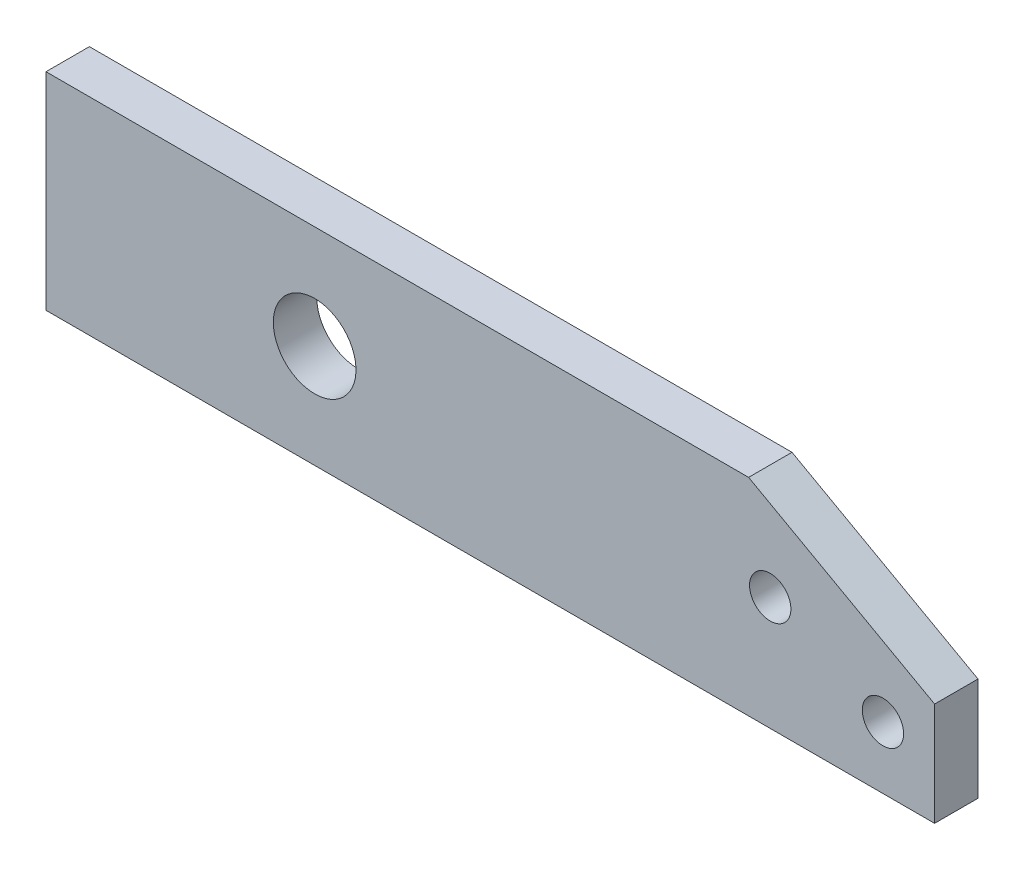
ISO-10303-21;
HEADER;
FILE_DESCRIPTION(('STEP AP214'),'2;1');
FILE_NAME('part.step','',(''),(''),'','','');
FILE_SCHEMA(('AUTOMOTIVE_DESIGN { 1 0 10303 214 1 1 1 1 }'));
ENDSEC;
DATA;
#1=APPLICATION_CONTEXT('core data for automotive mechanical design processes');
#2=APPLICATION_PROTOCOL_DEFINITION('international standard','automotive_design',2000,#1);
#3=PRODUCT_CONTEXT('',#1,'mechanical');
#4=PRODUCT('Part','Part','',(#3));
#5=PRODUCT_RELATED_PRODUCT_CATEGORY('part','',(#4));
#6=PRODUCT_DEFINITION_FORMATION('','',#4);
#7=PRODUCT_DEFINITION_CONTEXT('part definition',#1,'design');
#8=PRODUCT_DEFINITION('design','',#6,#7);
#9=PRODUCT_DEFINITION_SHAPE('','',#8);
#10=(LENGTH_UNIT() NAMED_UNIT(*) SI_UNIT(.MILLI.,.METRE.));
#11=(NAMED_UNIT(*) PLANE_ANGLE_UNIT() SI_UNIT($,.RADIAN.));
#12=(NAMED_UNIT(*) SI_UNIT($,.STERADIAN.) SOLID_ANGLE_UNIT());
#13=UNCERTAINTY_MEASURE_WITH_UNIT(LENGTH_MEASURE(1.E-05),#10,'distance_accuracy_value','');
#14=(GEOMETRIC_REPRESENTATION_CONTEXT(3) GLOBAL_UNCERTAINTY_ASSIGNED_CONTEXT((#13)) GLOBAL_UNIT_ASSIGNED_CONTEXT((#10,
#11,#12)) REPRESENTATION_CONTEXT('',''));
#15=CARTESIAN_POINT('',(0.,0.,0.));
#16=DIRECTION('',(0.,0.,1.));
#17=DIRECTION('',(1.,0.,0.));
#18=AXIS2_PLACEMENT_3D('',#15,#16,#17);
#19=CARTESIAN_POINT('',(4.44089209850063E-13,-100.000000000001,21.));
#20=DIRECTION('',(0.,0.,1.));
#21=DIRECTION('',(1.,0.,0.));
#22=AXIS2_PLACEMENT_3D('',#19,#20,#21);
#23=PLANE('',#22);
#24=CARTESIAN_POINT('',(350.456439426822,-44.9999999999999,21.));
#25=DIRECTION('',(0.,0.,1.));
#26=DIRECTION('',(1.,0.,0.));
#27=AXIS2_PLACEMENT_3D('',#24,#25,#26);
#28=CIRCLE('',#27,9.99999999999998);
#29=CARTESIAN_POINT('',(340.456439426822,-44.9999999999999,21.));
#30=VERTEX_POINT('',#29);
#31=EDGE_CURVE('E151',#30,#30,#28,.T.);
#32=ORIENTED_EDGE('',*,*,#31,.F.);
#33=EDGE_LOOP('',(#32));
#34=FACE_BOUND('',#33,.T.);
#35=DIRECTION('',(0.,-1.,0.));
#36=VECTOR('',#35,1.);
#37=CARTESIAN_POINT('',(0.,0.,21.));
#38=LINE('',#37,#36);
#39=CARTESIAN_POINT('',(0.,0.,21.));
#40=VERTEX_POINT('',#39);
#41=CARTESIAN_POINT('',(4.44089209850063E-13,-100.000000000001,21.));
#42=VERTEX_POINT('',#41);
#43=EDGE_CURVE('E118',#40,#42,#38,.T.);
#44=ORIENTED_EDGE('',*,*,#43,.T.);
#45=DIRECTION('',(1.,0.,0.));
#46=VECTOR('',#45,1.);
#47=CARTESIAN_POINT('',(4.44089209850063E-13,-100.000000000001,21.));
#48=LINE('',#47,#46);
#49=CARTESIAN_POINT('',(430.000000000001,-100.000000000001,21.));
#50=VERTEX_POINT('',#49);
#51=EDGE_CURVE('E100',#42,#50,#48,.T.);
#52=ORIENTED_EDGE('',*,*,#51,.T.);
#53=DIRECTION('',(0.,1.,0.));
#54=VECTOR('',#53,1.);
#55=CARTESIAN_POINT('',(430.000000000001,-50.0000000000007,21.));
#56=LINE('',#55,#54);
#57=CARTESIAN_POINT('',(430.000000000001,-50.0000000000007,21.));
#58=VERTEX_POINT('',#57);
#59=EDGE_CURVE('E121',#50,#58,#56,.T.);
#60=ORIENTED_EDGE('',*,*,#59,.T.);
#61=DIRECTION('',(-0.874157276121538,0.485642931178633,0.));
#62=VECTOR('',#61,1.);
#63=CARTESIAN_POINT('',(340.,-8.88178419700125E-13,21.));
#64=LINE('',#63,#62);
#65=CARTESIAN_POINT('',(340.,-8.88178419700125E-13,21.));
#66=VERTEX_POINT('',#65);
#67=EDGE_CURVE('E59',#58,#66,#64,.T.);
#68=ORIENTED_EDGE('',*,*,#67,.T.);
#69=DIRECTION('',(-1.,0.,0.));
#70=VECTOR('',#69,1.);
#71=CARTESIAN_POINT('',(0.,0.,21.));
#72=LINE('',#71,#70);
#73=EDGE_CURVE('E52',#66,#40,#72,.T.);
#74=ORIENTED_EDGE('',*,*,#73,.T.);
#75=EDGE_LOOP('',(#44,#52,#60,#68,#74));
#76=FACE_BOUND('',#75,.T.);
#77=CARTESIAN_POINT('',(405.,-70.0000000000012,21.));
#78=DIRECTION('',(0.,0.,1.));
#79=DIRECTION('',(1.,0.,0.));
#80=AXIS2_PLACEMENT_3D('',#77,#78,#79);
#81=CIRCLE('',#80,10.);
#82=CARTESIAN_POINT('',(395.,-70.0000000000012,21.));
#83=VERTEX_POINT('',#82);
#84=EDGE_CURVE('E105',#83,#83,#81,.T.);
#85=ORIENTED_EDGE('',*,*,#84,.F.);
#86=EDGE_LOOP('',(#85));
#87=FACE_BOUND('',#86,.T.);
#88=CARTESIAN_POINT('',(130.,-50.0000000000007,21.));
#89=DIRECTION('',(0.,0.,1.));
#90=DIRECTION('',(1.,0.,0.));
#91=AXIS2_PLACEMENT_3D('',#88,#89,#90);
#92=CIRCLE('',#91,20.);
#93=CARTESIAN_POINT('',(110.,-50.0000000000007,21.));
#94=VERTEX_POINT('',#93);
#95=EDGE_CURVE('E145',#94,#94,#92,.T.);
#96=ORIENTED_EDGE('',*,*,#95,.F.);
#97=EDGE_LOOP('',(#96));
#98=FACE_BOUND('',#97,.T.);
#99=ADVANCED_FACE('F37',(#34,#76,#87,#98),#23,.T.);
#100=CARTESIAN_POINT('',(4.44089209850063E-13,-100.000000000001,0.));
#101=DIRECTION('',(0.,0.,1.));
#102=DIRECTION('',(1.,0.,0.));
#103=AXIS2_PLACEMENT_3D('',#100,#101,#102);
#104=PLANE('',#103);
#105=CARTESIAN_POINT('',(350.456439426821,-44.9999999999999,0.));
#106=DIRECTION('',(0.,0.,1.));
#107=DIRECTION('',(1.,0.,0.));
#108=AXIS2_PLACEMENT_3D('',#105,#106,#107);
#109=CIRCLE('',#108,9.99999999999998);
#110=CARTESIAN_POINT('',(340.456439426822,-44.9999999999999,0.));
#111=VERTEX_POINT('',#110);
#112=EDGE_CURVE('E147',#111,#111,#109,.T.);
#113=ORIENTED_EDGE('',*,*,#112,.T.);
#114=EDGE_LOOP('',(#113));
#115=FACE_BOUND('',#114,.T.);
#116=DIRECTION('',(0.,-1.,0.));
#117=VECTOR('',#116,1.);
#118=CARTESIAN_POINT('',(0.,0.,0.));
#119=LINE('',#118,#117);
#120=CARTESIAN_POINT('',(0.,0.,0.));
#121=VERTEX_POINT('',#120);
#122=CARTESIAN_POINT('',(4.44089209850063E-13,-100.000000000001,0.));
#123=VERTEX_POINT('',#122);
#124=EDGE_CURVE('E91',#121,#123,#119,.T.);
#125=ORIENTED_EDGE('',*,*,#124,.F.);
#126=DIRECTION('',(-1.,0.,0.));
#127=VECTOR('',#126,1.);
#128=CARTESIAN_POINT('',(0.,0.,0.));
#129=LINE('',#128,#127);
#130=CARTESIAN_POINT('',(340.,-8.88178419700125E-13,0.));
#131=VERTEX_POINT('',#130);
#132=EDGE_CURVE('E116',#131,#121,#129,.T.);
#133=ORIENTED_EDGE('',*,*,#132,.F.);
#134=DIRECTION('',(-0.874157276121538,0.485642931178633,0.));
#135=VECTOR('',#134,1.);
#136=CARTESIAN_POINT('',(340.,-8.88178419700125E-13,0.));
#137=LINE('',#136,#135);
#138=CARTESIAN_POINT('',(430.000000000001,-50.0000000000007,0.));
#139=VERTEX_POINT('',#138);
#140=EDGE_CURVE('E113',#139,#131,#137,.T.);
#141=ORIENTED_EDGE('',*,*,#140,.F.);
#142=DIRECTION('',(0.,1.,0.));
#143=VECTOR('',#142,1.);
#144=CARTESIAN_POINT('',(430.000000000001,-50.0000000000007,0.));
#145=LINE('',#144,#143);
#146=CARTESIAN_POINT('',(430.000000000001,-100.000000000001,0.));
#147=VERTEX_POINT('',#146);
#148=EDGE_CURVE('E93',#147,#139,#145,.T.);
#149=ORIENTED_EDGE('',*,*,#148,.F.);
#150=DIRECTION('',(1.,0.,0.));
#151=VECTOR('',#150,1.);
#152=CARTESIAN_POINT('',(4.44089209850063E-13,-100.000000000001,0.));
#153=LINE('',#152,#151);
#154=EDGE_CURVE('E86',#123,#147,#153,.T.);
#155=ORIENTED_EDGE('',*,*,#154,.F.);
#156=EDGE_LOOP('',(#125,#133,#141,#149,#155));
#157=FACE_BOUND('',#156,.T.);
#158=CARTESIAN_POINT('',(405.,-70.0000000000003,0.));
#159=DIRECTION('',(0.,0.,1.));
#160=DIRECTION('',(1.,0.,0.));
#161=AXIS2_PLACEMENT_3D('',#158,#159,#160);
#162=CIRCLE('',#161,10.);
#163=CARTESIAN_POINT('',(395.,-70.0000000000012,0.));
#164=VERTEX_POINT('',#163);
#165=EDGE_CURVE('E108',#164,#164,#162,.T.);
#166=ORIENTED_EDGE('',*,*,#165,.T.);
#167=EDGE_LOOP('',(#166));
#168=FACE_BOUND('',#167,.T.);
#169=CARTESIAN_POINT('',(130.,-50.0000000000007,0.));
#170=DIRECTION('',(0.,0.,1.));
#171=DIRECTION('',(1.,0.,0.));
#172=AXIS2_PLACEMENT_3D('',#169,#170,#171);
#173=CIRCLE('',#172,20.);
#174=CARTESIAN_POINT('',(110.,-50.0000000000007,0.));
#175=VERTEX_POINT('',#174);
#176=EDGE_CURVE('E148',#175,#175,#173,.T.);
#177=ORIENTED_EDGE('',*,*,#176,.T.);
#178=EDGE_LOOP('',(#177));
#179=FACE_BOUND('',#178,.T.);
#180=ADVANCED_FACE('F87',(#115,#157,#168,#179),#104,.F.);
#181=CARTESIAN_POINT('',(0.,0.,21.));
#182=DIRECTION('',(1.,0.,0.));
#183=DIRECTION('',(0.,1.,0.));
#184=AXIS2_PLACEMENT_3D('',#181,#182,#183);
#185=PLANE('',#184);
#186=ORIENTED_EDGE('',*,*,#124,.T.);
#187=DIRECTION('',(0.,0.,-1.));
#188=VECTOR('',#187,1.);
#189=CARTESIAN_POINT('',(4.44089209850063E-13,-100.000000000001,21.));
#190=LINE('',#189,#188);
#191=EDGE_CURVE('E11',#42,#123,#190,.T.);
#192=ORIENTED_EDGE('',*,*,#191,.F.);
#193=ORIENTED_EDGE('',*,*,#43,.F.);
#194=DIRECTION('',(0.,0.,-1.));
#195=VECTOR('',#194,1.);
#196=CARTESIAN_POINT('',(0.,0.,21.));
#197=LINE('',#196,#195);
#198=EDGE_CURVE('E104',#40,#121,#197,.T.);
#199=ORIENTED_EDGE('',*,*,#198,.T.);
#200=EDGE_LOOP('',(#186,#192,#193,#199));
#201=FACE_BOUND('',#200,.T.);
#202=ADVANCED_FACE('F39',(#201),#185,.F.);
#203=CARTESIAN_POINT('',(4.44089209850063E-13,-100.000000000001,21.));
#204=DIRECTION('',(0.,1.,0.));
#205=DIRECTION('',(0.,0.,1.));
#206=AXIS2_PLACEMENT_3D('',#203,#204,#205);
#207=PLANE('',#206);
#208=ORIENTED_EDGE('',*,*,#154,.T.);
#209=DIRECTION('',(0.,0.,-1.));
#210=VECTOR('',#209,1.);
#211=CARTESIAN_POINT('',(430.000000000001,-100.000000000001,21.));
#212=LINE('',#211,#210);
#213=EDGE_CURVE('E45',#50,#147,#212,.T.);
#214=ORIENTED_EDGE('',*,*,#213,.F.);
#215=ORIENTED_EDGE('',*,*,#51,.F.);
#216=ORIENTED_EDGE('',*,*,#191,.T.);
#217=EDGE_LOOP('',(#208,#214,#215,#216));
#218=FACE_BOUND('',#217,.T.);
#219=ADVANCED_FACE('F99',(#218),#207,.F.);
#220=CARTESIAN_POINT('',(430.000000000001,-50.0000000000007,21.));
#221=DIRECTION('',(-1.,0.,0.));
#222=DIRECTION('',(0.,-1.,0.));
#223=AXIS2_PLACEMENT_3D('',#220,#221,#222);
#224=PLANE('',#223);
#225=ORIENTED_EDGE('',*,*,#148,.T.);
#226=DIRECTION('',(0.,0.,-1.));
#227=VECTOR('',#226,1.);
#228=CARTESIAN_POINT('',(430.000000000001,-50.0000000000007,21.));
#229=LINE('',#228,#227);
#230=EDGE_CURVE('E130',#58,#139,#229,.T.);
#231=ORIENTED_EDGE('',*,*,#230,.F.);
#232=ORIENTED_EDGE('',*,*,#59,.F.);
#233=ORIENTED_EDGE('',*,*,#213,.T.);
#234=EDGE_LOOP('',(#225,#231,#232,#233));
#235=FACE_BOUND('',#234,.T.);
#236=ADVANCED_FACE('F135',(#235),#224,.F.);
#237=CARTESIAN_POINT('',(340.,-8.88178419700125E-13,21.));
#238=DIRECTION('',(-0.485642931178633,-0.874157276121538,0.));
#239=DIRECTION('',(0.874157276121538,-0.485642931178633,0.));
#240=AXIS2_PLACEMENT_3D('',#237,#238,#239);
#241=PLANE('',#240);
#242=ORIENTED_EDGE('',*,*,#140,.T.);
#243=DIRECTION('',(0.,0.,-1.));
#244=VECTOR('',#243,1.);
#245=CARTESIAN_POINT('',(340.,-8.88178419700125E-13,21.));
#246=LINE('',#245,#244);
#247=EDGE_CURVE('E127',#66,#131,#246,.T.);
#248=ORIENTED_EDGE('',*,*,#247,.F.);
#249=ORIENTED_EDGE('',*,*,#67,.F.);
#250=ORIENTED_EDGE('',*,*,#230,.T.);
#251=EDGE_LOOP('',(#242,#248,#249,#250));
#252=FACE_BOUND('',#251,.T.);
#253=ADVANCED_FACE('F174',(#252),#241,.F.);
#254=CARTESIAN_POINT('',(0.,0.,21.));
#255=DIRECTION('',(0.,-1.,0.));
#256=DIRECTION('',(0.,0.,-1.));
#257=AXIS2_PLACEMENT_3D('',#254,#255,#256);
#258=PLANE('',#257);
#259=ORIENTED_EDGE('',*,*,#132,.T.);
#260=ORIENTED_EDGE('',*,*,#198,.F.);
#261=ORIENTED_EDGE('',*,*,#73,.F.);
#262=ORIENTED_EDGE('',*,*,#247,.T.);
#263=EDGE_LOOP('',(#259,#260,#261,#262));
#264=FACE_BOUND('',#263,.T.);
#265=ADVANCED_FACE('F164',(#264),#258,.F.);
#266=CARTESIAN_POINT('',(405.,-70.0000000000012,21.));
#267=DIRECTION('',(0.,0.,-1.));
#268=DIRECTION('',(-1.,0.,0.));
#269=AXIS2_PLACEMENT_3D('',#266,#267,#268);
#270=CYLINDRICAL_SURFACE('',#269,10.);
#271=CARTESIAN_POINT('',(395.,-70.0000000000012,21.));
#272=CARTESIAN_POINT('',(395.,-70.0000000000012,20.78125));
#273=CARTESIAN_POINT('',(395.,-70.0000000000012,20.5625));
#274=CARTESIAN_POINT('',(395.,-70.0000000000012,20.125));
#275=CARTESIAN_POINT('',(395.,-70.0000000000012,19.90625));
#276=CARTESIAN_POINT('',(395.,-70.0000000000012,19.46875));
#277=CARTESIAN_POINT('',(395.,-70.0000000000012,19.25));
#278=CARTESIAN_POINT('',(395.,-70.0000000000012,18.8125));
#279=CARTESIAN_POINT('',(395.,-70.0000000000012,18.59375));
#280=CARTESIAN_POINT('',(395.,-70.0000000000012,18.15625));
#281=CARTESIAN_POINT('',(395.,-70.0000000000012,17.9375));
#282=CARTESIAN_POINT('',(395.,-70.0000000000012,17.5));
#283=CARTESIAN_POINT('',(395.,-70.0000000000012,17.28125));
#284=CARTESIAN_POINT('',(395.,-70.0000000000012,16.84375));
#285=CARTESIAN_POINT('',(395.,-70.0000000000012,16.625));
#286=CARTESIAN_POINT('',(395.,-70.0000000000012,16.1875));
#287=CARTESIAN_POINT('',(395.,-70.0000000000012,15.96875));
#288=CARTESIAN_POINT('',(395.,-70.0000000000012,15.53125));
#289=CARTESIAN_POINT('',(395.,-70.0000000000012,15.3125));
#290=CARTESIAN_POINT('',(395.,-70.0000000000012,14.875));
#291=CARTESIAN_POINT('',(395.,-70.0000000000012,14.65625));
#292=CARTESIAN_POINT('',(395.,-70.0000000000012,14.21875));
#293=CARTESIAN_POINT('',(395.,-70.0000000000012,14.));
#294=CARTESIAN_POINT('',(395.,-70.0000000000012,13.5625));
#295=CARTESIAN_POINT('',(395.,-70.0000000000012,13.34375));
#296=CARTESIAN_POINT('',(395.,-70.0000000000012,12.90625));
#297=CARTESIAN_POINT('',(395.,-70.0000000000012,12.6875));
#298=CARTESIAN_POINT('',(395.,-70.0000000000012,12.25));
#299=CARTESIAN_POINT('',(395.,-70.0000000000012,12.03125));
#300=CARTESIAN_POINT('',(395.,-70.0000000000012,11.59375));
#301=CARTESIAN_POINT('',(395.,-70.0000000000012,11.375));
#302=CARTESIAN_POINT('',(395.,-70.0000000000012,10.9375));
#303=CARTESIAN_POINT('',(395.,-70.0000000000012,10.71875));
#304=CARTESIAN_POINT('',(395.,-70.0000000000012,10.28125));
#305=CARTESIAN_POINT('',(395.,-70.0000000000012,10.0625));
#306=CARTESIAN_POINT('',(395.,-70.0000000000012,9.62500000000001));
#307=CARTESIAN_POINT('',(395.,-70.0000000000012,9.40625000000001));
#308=CARTESIAN_POINT('',(395.,-70.0000000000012,8.96875000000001));
#309=CARTESIAN_POINT('',(395.,-70.0000000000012,8.75000000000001));
#310=CARTESIAN_POINT('',(395.,-70.0000000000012,8.31250000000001));
#311=CARTESIAN_POINT('',(395.,-70.0000000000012,8.09375000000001));
#312=CARTESIAN_POINT('',(395.,-70.0000000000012,7.65625000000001));
#313=CARTESIAN_POINT('',(395.,-70.0000000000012,7.43750000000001));
#314=CARTESIAN_POINT('',(395.,-70.0000000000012,7.00000000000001));
#315=CARTESIAN_POINT('',(395.,-70.0000000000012,6.78125000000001));
#316=CARTESIAN_POINT('',(395.,-70.0000000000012,6.34375000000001));
#317=CARTESIAN_POINT('',(395.,-70.0000000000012,6.12500000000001));
#318=CARTESIAN_POINT('',(395.,-70.0000000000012,5.68750000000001));
#319=CARTESIAN_POINT('',(395.,-70.0000000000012,5.46875000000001));
#320=CARTESIAN_POINT('',(395.,-70.0000000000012,5.03125000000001));
#321=CARTESIAN_POINT('',(395.,-70.0000000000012,4.81250000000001));
#322=CARTESIAN_POINT('',(395.,-70.0000000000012,4.37500000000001));
#323=CARTESIAN_POINT('',(395.,-70.0000000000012,4.15625000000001));
#324=CARTESIAN_POINT('',(395.,-70.0000000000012,3.71875000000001));
#325=CARTESIAN_POINT('',(395.,-70.0000000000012,3.50000000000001));
#326=CARTESIAN_POINT('',(395.,-70.0000000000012,3.06250000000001));
#327=CARTESIAN_POINT('',(395.,-70.0000000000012,2.84375000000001));
#328=CARTESIAN_POINT('',(395.,-70.0000000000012,2.40625000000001));
#329=CARTESIAN_POINT('',(395.,-70.0000000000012,2.18750000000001));
#330=CARTESIAN_POINT('',(395.,-70.0000000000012,1.75000000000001));
#331=CARTESIAN_POINT('',(395.,-70.0000000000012,1.53125));
#332=CARTESIAN_POINT('',(395.,-70.0000000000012,1.09375));
#333=CARTESIAN_POINT('',(395.,-70.0000000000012,0.875000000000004));
#334=CARTESIAN_POINT('',(395.,-70.0000000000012,0.437500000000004));
#335=CARTESIAN_POINT('',(395.,-70.0000000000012,0.218750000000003));
#336=CARTESIAN_POINT('',(395.,-70.0000000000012,0.));
#337=B_SPLINE_CURVE_WITH_KNOTS('',3,(#271,#272,#273,#274,#275,#276,#277,#278,#279,#280,#281,
#282,#283,#284,#285,#286,#287,#288,#289,#290,#291,#292,#293,#294,#295,#296,#297,#298,#299,#300,
#301,#302,#303,#304,#305,#306,#307,#308,#309,#310,#311,#312,#313,#314,#315,#316,#317,#318,#319,
#320,#321,#322,#323,#324,#325,#326,#327,#328,#329,#330,#331,#332,#333,#334,#335,#336),
.UNSPECIFIED.,.F.,.F.,(4,2,2,2,2,2,2,2,2,2,2,2,2,2,2,2,2,2,2,2,2,2,2,2,2,2,2,2,2,2,2,2,4),(0.,
0.656249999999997,1.3125,1.96875,2.625,3.28125,3.9375,4.59375,5.25,5.90625,6.5625,7.21875,7.875,
8.53125,9.18750000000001,9.84375000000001,10.5,11.15625,11.8125,12.46875,13.125,13.78125,
14.4375,15.09375,15.75,16.40625,17.0625,17.71875,18.375,19.03125,19.6875,20.34375,21.),.UNSPECIFIED.);
#338=EDGE_CURVE('BSEAM161',#83,#164,#337,.T.);
#339=ORIENTED_EDGE('',*,*,#84,.T.);
#340=ORIENTED_EDGE('',*,*,#165,.F.);
#341=ORIENTED_EDGE('',*,*,#338,.T.);
#342=ORIENTED_EDGE('',*,*,#338,.F.);
#343=EDGE_LOOP('',(#339,#341,#340,#342));
#344=FACE_BOUND('',#343,.T.);
#345=ADVANCED_FACE('F161',(#344),#270,.F.);
#346=CARTESIAN_POINT('',(350.456439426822,-44.9999999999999,21.));
#347=DIRECTION('',(0.,0.,-1.));
#348=DIRECTION('',(-1.,0.,0.));
#349=AXIS2_PLACEMENT_3D('',#346,#347,#348);
#350=CYLINDRICAL_SURFACE('',#349,9.99999999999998);
#351=CARTESIAN_POINT('',(340.456439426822,-44.9999999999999,21.));
#352=CARTESIAN_POINT('',(340.456439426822,-44.9999999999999,20.78125));
#353=CARTESIAN_POINT('',(340.456439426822,-44.9999999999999,20.5625));
#354=CARTESIAN_POINT('',(340.456439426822,-44.9999999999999,20.125));
#355=CARTESIAN_POINT('',(340.456439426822,-44.9999999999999,19.90625));
#356=CARTESIAN_POINT('',(340.456439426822,-44.9999999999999,19.46875));
#357=CARTESIAN_POINT('',(340.456439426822,-44.9999999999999,19.25));
#358=CARTESIAN_POINT('',(340.456439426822,-44.9999999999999,18.8125));
#359=CARTESIAN_POINT('',(340.456439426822,-44.9999999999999,18.59375));
#360=CARTESIAN_POINT('',(340.456439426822,-44.9999999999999,18.15625));
#361=CARTESIAN_POINT('',(340.456439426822,-44.9999999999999,17.9375));
#362=CARTESIAN_POINT('',(340.456439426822,-44.9999999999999,17.5));
#363=CARTESIAN_POINT('',(340.456439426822,-44.9999999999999,17.28125));
#364=CARTESIAN_POINT('',(340.456439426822,-44.9999999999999,16.84375));
#365=CARTESIAN_POINT('',(340.456439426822,-44.9999999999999,16.625));
#366=CARTESIAN_POINT('',(340.456439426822,-44.9999999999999,16.1875));
#367=CARTESIAN_POINT('',(340.456439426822,-44.9999999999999,15.96875));
#368=CARTESIAN_POINT('',(340.456439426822,-44.9999999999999,15.53125));
#369=CARTESIAN_POINT('',(340.456439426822,-44.9999999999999,15.3125));
#370=CARTESIAN_POINT('',(340.456439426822,-44.9999999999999,14.875));
#371=CARTESIAN_POINT('',(340.456439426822,-44.9999999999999,14.65625));
#372=CARTESIAN_POINT('',(340.456439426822,-44.9999999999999,14.21875));
#373=CARTESIAN_POINT('',(340.456439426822,-44.9999999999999,14.));
#374=CARTESIAN_POINT('',(340.456439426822,-44.9999999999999,13.5625));
#375=CARTESIAN_POINT('',(340.456439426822,-44.9999999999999,13.34375));
#376=CARTESIAN_POINT('',(340.456439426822,-44.9999999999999,12.90625));
#377=CARTESIAN_POINT('',(340.456439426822,-44.9999999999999,12.6875));
#378=CARTESIAN_POINT('',(340.456439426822,-44.9999999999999,12.25));
#379=CARTESIAN_POINT('',(340.456439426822,-44.9999999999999,12.03125));
#380=CARTESIAN_POINT('',(340.456439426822,-44.9999999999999,11.59375));
#381=CARTESIAN_POINT('',(340.456439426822,-44.9999999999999,11.375));
#382=CARTESIAN_POINT('',(340.456439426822,-44.9999999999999,10.9375));
#383=CARTESIAN_POINT('',(340.456439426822,-44.9999999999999,10.71875));
#384=CARTESIAN_POINT('',(340.456439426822,-44.9999999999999,10.28125));
#385=CARTESIAN_POINT('',(340.456439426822,-44.9999999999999,10.0625));
#386=CARTESIAN_POINT('',(340.456439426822,-44.9999999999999,9.62500000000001));
#387=CARTESIAN_POINT('',(340.456439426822,-44.9999999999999,9.40625000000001));
#388=CARTESIAN_POINT('',(340.456439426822,-44.9999999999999,8.96875000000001));
#389=CARTESIAN_POINT('',(340.456439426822,-44.9999999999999,8.75000000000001));
#390=CARTESIAN_POINT('',(340.456439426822,-44.9999999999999,8.31250000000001));
#391=CARTESIAN_POINT('',(340.456439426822,-44.9999999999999,8.09375000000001));
#392=CARTESIAN_POINT('',(340.456439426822,-44.9999999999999,7.65625000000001));
#393=CARTESIAN_POINT('',(340.456439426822,-44.9999999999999,7.43750000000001));
#394=CARTESIAN_POINT('',(340.456439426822,-44.9999999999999,7.00000000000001));
#395=CARTESIAN_POINT('',(340.456439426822,-44.9999999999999,6.78125000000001));
#396=CARTESIAN_POINT('',(340.456439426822,-44.9999999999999,6.34375000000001));
#397=CARTESIAN_POINT('',(340.456439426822,-44.9999999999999,6.12500000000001));
#398=CARTESIAN_POINT('',(340.456439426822,-44.9999999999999,5.68750000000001));
#399=CARTESIAN_POINT('',(340.456439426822,-44.9999999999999,5.46875000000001));
#400=CARTESIAN_POINT('',(340.456439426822,-44.9999999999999,5.03125000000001));
#401=CARTESIAN_POINT('',(340.456439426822,-44.9999999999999,4.81250000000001));
#402=CARTESIAN_POINT('',(340.456439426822,-44.9999999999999,4.37500000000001));
#403=CARTESIAN_POINT('',(340.456439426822,-44.9999999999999,4.15625000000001));
#404=CARTESIAN_POINT('',(340.456439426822,-44.9999999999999,3.71875000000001));
#405=CARTESIAN_POINT('',(340.456439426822,-44.9999999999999,3.50000000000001));
#406=CARTESIAN_POINT('',(340.456439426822,-44.9999999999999,3.06250000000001));
#407=CARTESIAN_POINT('',(340.456439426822,-44.9999999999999,2.84375000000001));
#408=CARTESIAN_POINT('',(340.456439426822,-44.9999999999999,2.40625000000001));
#409=CARTESIAN_POINT('',(340.456439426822,-44.9999999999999,2.18750000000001));
#410=CARTESIAN_POINT('',(340.456439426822,-44.9999999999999,1.75000000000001));
#411=CARTESIAN_POINT('',(340.456439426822,-44.9999999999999,1.53125));
#412=CARTESIAN_POINT('',(340.456439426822,-44.9999999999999,1.09375));
#413=CARTESIAN_POINT('',(340.456439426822,-44.9999999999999,0.875000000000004));
#414=CARTESIAN_POINT('',(340.456439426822,-44.9999999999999,0.437500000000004));
#415=CARTESIAN_POINT('',(340.456439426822,-44.9999999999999,0.218750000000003));
#416=CARTESIAN_POINT('',(340.456439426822,-44.9999999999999,0.));
#417=B_SPLINE_CURVE_WITH_KNOTS('',3,(#351,#352,#353,#354,#355,#356,#357,#358,#359,#360,#361,
#362,#363,#364,#365,#366,#367,#368,#369,#370,#371,#372,#373,#374,#375,#376,#377,#378,#379,#380,
#381,#382,#383,#384,#385,#386,#387,#388,#389,#390,#391,#392,#393,#394,#395,#396,#397,#398,#399,
#400,#401,#402,#403,#404,#405,#406,#407,#408,#409,#410,#411,#412,#413,#414,#415,#416),
.UNSPECIFIED.,.F.,.F.,(4,2,2,2,2,2,2,2,2,2,2,2,2,2,2,2,2,2,2,2,2,2,2,2,2,2,2,2,2,2,2,2,4),(0.,
0.656249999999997,1.3125,1.96875,2.625,3.28125,3.9375,4.59375,5.25,5.90625,6.5625,7.21875,7.875,
8.53125,9.18750000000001,9.84375000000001,10.5,11.15625,11.8125,12.46875,13.125,13.78125,
14.4375,15.09375,15.75,16.40625,17.0625,17.71875,18.375,19.03125,19.6875,20.34375,21.),.UNSPECIFIED.);
#418=EDGE_CURVE('BSEAM163',#30,#111,#417,.T.);
#419=ORIENTED_EDGE('',*,*,#31,.T.);
#420=ORIENTED_EDGE('',*,*,#112,.F.);
#421=ORIENTED_EDGE('',*,*,#418,.T.);
#422=ORIENTED_EDGE('',*,*,#418,.F.);
#423=EDGE_LOOP('',(#419,#421,#420,#422));
#424=FACE_BOUND('',#423,.T.);
#425=ADVANCED_FACE('F163',(#424),#350,.F.);
#426=CARTESIAN_POINT('',(130.,-50.0000000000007,21.));
#427=DIRECTION('',(0.,0.,-1.));
#428=DIRECTION('',(-1.,0.,0.));
#429=AXIS2_PLACEMENT_3D('',#426,#427,#428);
#430=CYLINDRICAL_SURFACE('',#429,20.);
#431=CARTESIAN_POINT('',(110.,-50.0000000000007,21.));
#432=CARTESIAN_POINT('',(110.,-50.0000000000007,20.78125));
#433=CARTESIAN_POINT('',(110.,-50.0000000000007,20.5625));
#434=CARTESIAN_POINT('',(110.,-50.0000000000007,20.125));
#435=CARTESIAN_POINT('',(110.,-50.0000000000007,19.90625));
#436=CARTESIAN_POINT('',(110.,-50.0000000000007,19.46875));
#437=CARTESIAN_POINT('',(110.,-50.0000000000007,19.25));
#438=CARTESIAN_POINT('',(110.,-50.0000000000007,18.8125));
#439=CARTESIAN_POINT('',(110.,-50.0000000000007,18.59375));
#440=CARTESIAN_POINT('',(110.,-50.0000000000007,18.15625));
#441=CARTESIAN_POINT('',(110.,-50.0000000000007,17.9375));
#442=CARTESIAN_POINT('',(110.,-50.0000000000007,17.5));
#443=CARTESIAN_POINT('',(110.,-50.0000000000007,17.28125));
#444=CARTESIAN_POINT('',(110.,-50.0000000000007,16.84375));
#445=CARTESIAN_POINT('',(110.,-50.0000000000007,16.625));
#446=CARTESIAN_POINT('',(110.,-50.0000000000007,16.1875));
#447=CARTESIAN_POINT('',(110.,-50.0000000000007,15.96875));
#448=CARTESIAN_POINT('',(110.,-50.0000000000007,15.53125));
#449=CARTESIAN_POINT('',(110.,-50.0000000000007,15.3125));
#450=CARTESIAN_POINT('',(110.,-50.0000000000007,14.875));
#451=CARTESIAN_POINT('',(110.,-50.0000000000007,14.65625));
#452=CARTESIAN_POINT('',(110.,-50.0000000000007,14.21875));
#453=CARTESIAN_POINT('',(110.,-50.0000000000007,14.));
#454=CARTESIAN_POINT('',(110.,-50.0000000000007,13.5625));
#455=CARTESIAN_POINT('',(110.,-50.0000000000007,13.34375));
#456=CARTESIAN_POINT('',(110.,-50.0000000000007,12.90625));
#457=CARTESIAN_POINT('',(110.,-50.0000000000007,12.6875));
#458=CARTESIAN_POINT('',(110.,-50.0000000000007,12.25));
#459=CARTESIAN_POINT('',(110.,-50.0000000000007,12.03125));
#460=CARTESIAN_POINT('',(110.,-50.0000000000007,11.59375));
#461=CARTESIAN_POINT('',(110.,-50.0000000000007,11.375));
#462=CARTESIAN_POINT('',(110.,-50.0000000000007,10.9375));
#463=CARTESIAN_POINT('',(110.,-50.0000000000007,10.71875));
#464=CARTESIAN_POINT('',(110.,-50.0000000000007,10.28125));
#465=CARTESIAN_POINT('',(110.,-50.0000000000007,10.0625));
#466=CARTESIAN_POINT('',(110.,-50.0000000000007,9.62500000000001));
#467=CARTESIAN_POINT('',(110.,-50.0000000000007,9.40625000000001));
#468=CARTESIAN_POINT('',(110.,-50.0000000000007,8.96875000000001));
#469=CARTESIAN_POINT('',(110.,-50.0000000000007,8.75000000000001));
#470=CARTESIAN_POINT('',(110.,-50.0000000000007,8.31250000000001));
#471=CARTESIAN_POINT('',(110.,-50.0000000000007,8.09375000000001));
#472=CARTESIAN_POINT('',(110.,-50.0000000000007,7.65625000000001));
#473=CARTESIAN_POINT('',(110.,-50.0000000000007,7.43750000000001));
#474=CARTESIAN_POINT('',(110.,-50.0000000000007,7.00000000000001));
#475=CARTESIAN_POINT('',(110.,-50.0000000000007,6.78125000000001));
#476=CARTESIAN_POINT('',(110.,-50.0000000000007,6.34375000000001));
#477=CARTESIAN_POINT('',(110.,-50.0000000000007,6.12500000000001));
#478=CARTESIAN_POINT('',(110.,-50.0000000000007,5.68750000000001));
#479=CARTESIAN_POINT('',(110.,-50.0000000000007,5.46875000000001));
#480=CARTESIAN_POINT('',(110.,-50.0000000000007,5.03125000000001));
#481=CARTESIAN_POINT('',(110.,-50.0000000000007,4.81250000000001));
#482=CARTESIAN_POINT('',(110.,-50.0000000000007,4.37500000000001));
#483=CARTESIAN_POINT('',(110.,-50.0000000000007,4.15625000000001));
#484=CARTESIAN_POINT('',(110.,-50.0000000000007,3.71875000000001));
#485=CARTESIAN_POINT('',(110.,-50.0000000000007,3.50000000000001));
#486=CARTESIAN_POINT('',(110.,-50.0000000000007,3.06250000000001));
#487=CARTESIAN_POINT('',(110.,-50.0000000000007,2.84375000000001));
#488=CARTESIAN_POINT('',(110.,-50.0000000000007,2.40625000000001));
#489=CARTESIAN_POINT('',(110.,-50.0000000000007,2.18750000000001));
#490=CARTESIAN_POINT('',(110.,-50.0000000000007,1.75000000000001));
#491=CARTESIAN_POINT('',(110.,-50.0000000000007,1.53125));
#492=CARTESIAN_POINT('',(110.,-50.0000000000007,1.09375));
#493=CARTESIAN_POINT('',(110.,-50.0000000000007,0.875000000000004));
#494=CARTESIAN_POINT('',(110.,-50.0000000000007,0.437500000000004));
#495=CARTESIAN_POINT('',(110.,-50.0000000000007,0.218750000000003));
#496=CARTESIAN_POINT('',(110.,-50.0000000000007,0.));
#497=B_SPLINE_CURVE_WITH_KNOTS('',3,(#431,#432,#433,#434,#435,#436,#437,#438,#439,#440,#441,
#442,#443,#444,#445,#446,#447,#448,#449,#450,#451,#452,#453,#454,#455,#456,#457,#458,#459,#460,
#461,#462,#463,#464,#465,#466,#467,#468,#469,#470,#471,#472,#473,#474,#475,#476,#477,#478,#479,
#480,#481,#482,#483,#484,#485,#486,#487,#488,#489,#490,#491,#492,#493,#494,#495,#496),
.UNSPECIFIED.,.F.,.F.,(4,2,2,2,2,2,2,2,2,2,2,2,2,2,2,2,2,2,2,2,2,2,2,2,2,2,2,2,2,2,2,2,4),(0.,
0.656249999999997,1.3125,1.96875,2.625,3.28125,3.9375,4.59375,5.25,5.90625,6.5625,7.21875,7.875,
8.53125,9.18750000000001,9.84375000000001,10.5,11.15625,11.8125,12.46875,13.125,13.78125,
14.4375,15.09375,15.75,16.40625,17.0625,17.71875,18.375,19.03125,19.6875,20.34375,21.),.UNSPECIFIED.);
#498=EDGE_CURVE('BSEAM171',#94,#175,#497,.T.);
#499=ORIENTED_EDGE('',*,*,#95,.T.);
#500=ORIENTED_EDGE('',*,*,#176,.F.);
#501=ORIENTED_EDGE('',*,*,#498,.T.);
#502=ORIENTED_EDGE('',*,*,#498,.F.);
#503=EDGE_LOOP('',(#499,#501,#500,#502));
#504=FACE_BOUND('',#503,.T.);
#505=ADVANCED_FACE('F171',(#504),#430,.F.);
#506=CLOSED_SHELL('',(#99,#180,#202,#219,#236,#253,#265,#345,#425,#505));
#507=MANIFOLD_SOLID_BREP('B2',#506);
#508=ADVANCED_BREP_SHAPE_REPRESENTATION('',(#18,#507),#14);
#509=SHAPE_DEFINITION_REPRESENTATION(#9,#508);
ENDSEC;
END-ISO-10303-21;
